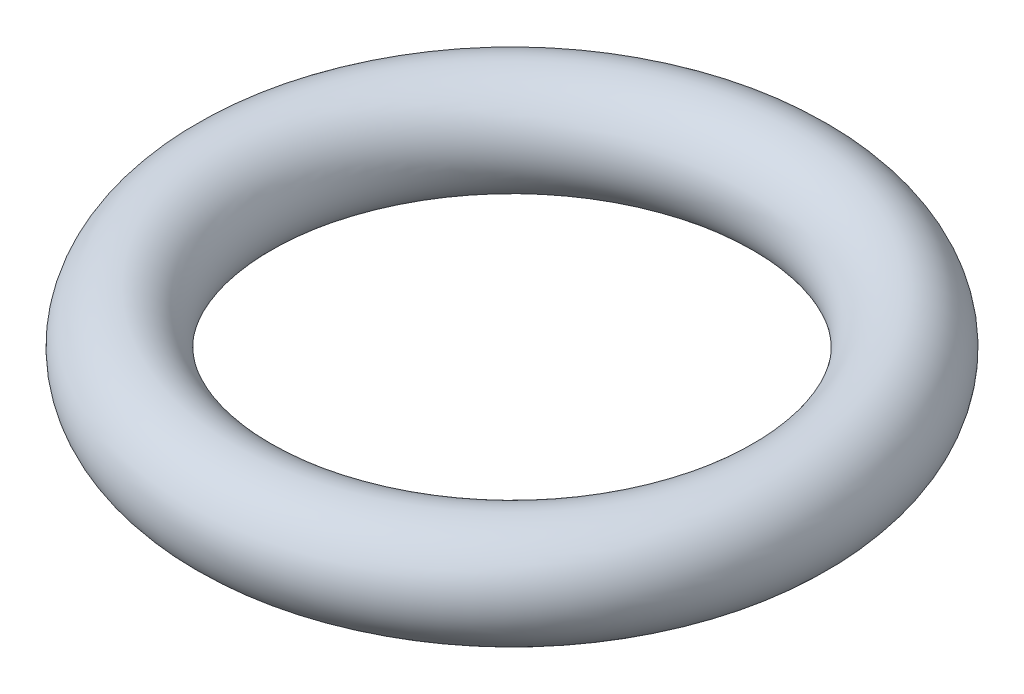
from build123d import *

# Parameters (mm, degrees)
PROFILE_R = 0.254


with BuildPart() as part:
    # Sweep1: sweep along a path in Path
    with BuildLine(Plane(origin=(0, 0, 0), x_dir=(1, 0, 0), z_dir=(0, 1, 0))) as sweep1_path:
        CenterArc((0, 0), 1.3589, 0, 360)
    # Profile → Sweep1 (sweep)
    with BuildSketch(Plane.XY):
        with Locations((1.3589, 0)):
            Circle(PROFILE_R)
    sweep(path=sweep1_path.line)


solid = part.part
